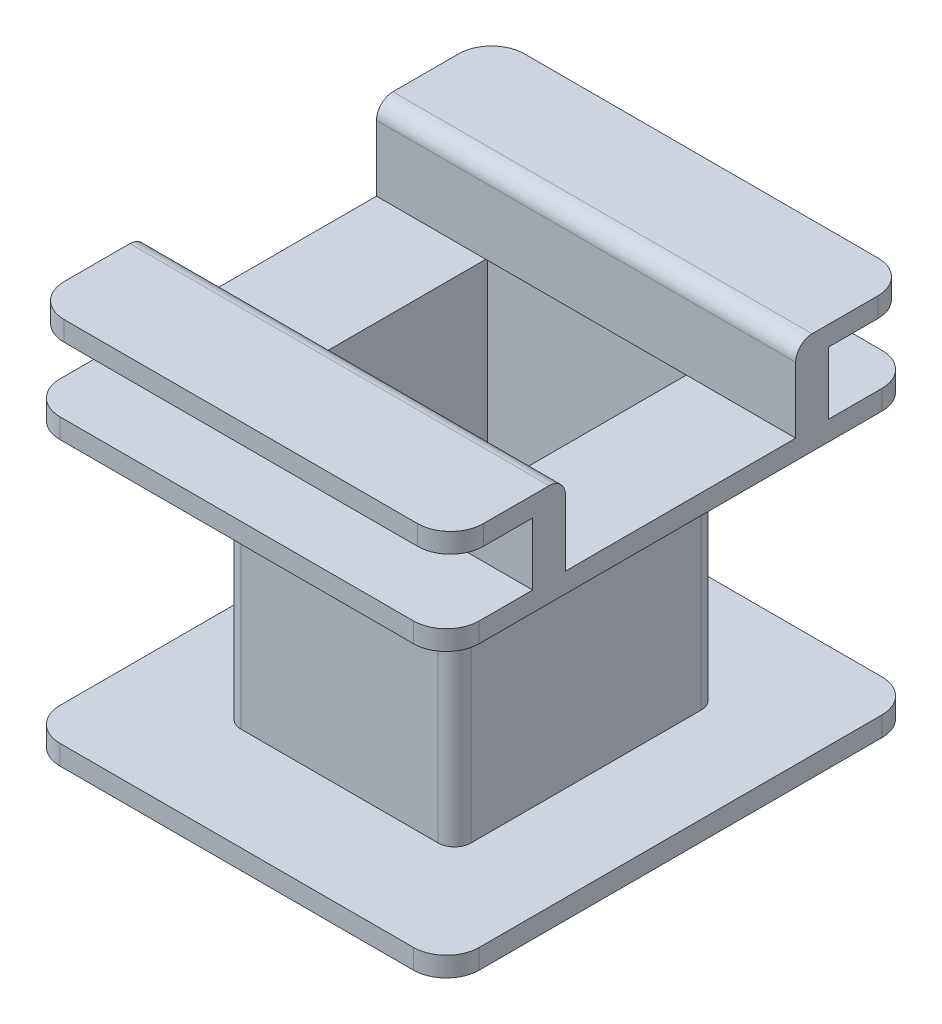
from build123d import *

# Parameters (mm, degrees)
SKETCH1_W               = 14
SKETCH1_H               = 16
BOSS_EXTRUDE1_DEPTH     = 16
FILLET1_R               = 1
CUT_EXTRUDE1_DEPTH      = 20.209372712
CUT_EXTRUDE1_DEPTH_BACK = 20.209372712
SKETCH2_W               = 12.2
SKETCH2_H               = 14.2
SKETCH3_W               = 25.5
SKETCH3_H               = 28.5
BOSS_EXTRUDE2_DEPTH     = 1.2
FILLET2_R               = 2
SKETCH4_W               = 25.5
SKETCH4_H               = 28.5
BOSS_EXTRUDE3_DEPTH     = 1.2
FILLET3_R               = 2
CUT_EXTRUDE2_DEPTH      = 27.536484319
CUT_EXTRUDE2_DEPTH_BACK = 27.536484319
SKETCH5_W               = 12.2
SKETCH5_H               = 14.2
SKETCH6_W               = 25.5
SKETCH6_H               = 1.998944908
BOSS_EXTRUDE4_DEPTH     = 5
SKETCH7_W               = 25.5
SKETCH7_H               = 1.2
BOSS_EXTRUDE5_DEPTH     = 5
FILLET4_R               = 2
SKETCH8_W               = 25.5
SKETCH8_H               = 1.997277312
BOSS_EXTRUDE6_DEPTH     = 5
SKETCH9_W               = 25.5
SKETCH9_H               = 1.2
BOSS_EXTRUDE7_DEPTH     = 5
FILLET5_R               = 2
FILLET6_R               = 1


with BuildPart() as part:
    # Sketch1 → Boss-Extrude1 (new body)
    with BuildSketch(Plane(origin=(0, 0, 0), x_dir=(1, 0, 0), z_dir=(0, 1, 0))):
        Rectangle(SKETCH1_W, SKETCH1_H)
    extrude(amount=BOSS_EXTRUDE1_DEPTH)

    # Fillet1
    fillet1_edges = [part.edges().sort_by_distance(p)[0] for p in [
        (7, 8, 8),
        (-7, 8, 8),
        (-7, 8, -8),
        (7, 8, -8),
    ]]
    fillet(fillet1_edges, radius=FILLET1_R)

    # Sketch2 → Cut-Extrude1 (cut, two sides: drawn at the far end of the back side and taken through both)
    with BuildSketch(Plane(origin=(0, 16, 0), x_dir=(1, 0, 0), z_dir=(0, 1, 0)).offset(-CUT_EXTRUDE1_DEPTH_BACK)):
        Rectangle(SKETCH2_W, SKETCH2_H)
    extrude(amount=CUT_EXTRUDE1_DEPTH + CUT_EXTRUDE1_DEPTH_BACK, mode=Mode.SUBTRACT)

    # Sketch3 → Boss-Extrude2 (add)
    with BuildSketch(Plane(origin=(0, 16, 0), x_dir=(1, 0, 0), z_dir=(0, 1, 0))):
        Rectangle(SKETCH3_W, SKETCH3_H)
    extrude(amount=BOSS_EXTRUDE2_DEPTH)

    # Fillet2
    fillet2_edges = [part.edges().sort_by_distance(p)[0] for p in [
        (12.75, 16.6, 14.25),
        (12.75, 16.6, -14.25),
        (-12.75, 16.6, -14.25),
        (-12.75, 16.6, 14.25),
    ]]
    fillet(fillet2_edges, radius=FILLET2_R)

    # Sketch4 → Boss-Extrude3 (add)
    with BuildSketch(Plane.XZ):
        Rectangle(SKETCH4_W, SKETCH4_H)
    extrude(amount=BOSS_EXTRUDE3_DEPTH)

    # Fillet3
    fillet3_edges = [part.edges().sort_by_distance(p)[0] for p in [
        (12.75, -0.6, -14.25),
        (12.75, -0.6, 14.25),
        (-12.75, -0.6, 14.25),
        (-12.75, -0.6, -14.25),
    ]]
    fillet(fillet3_edges, radius=FILLET3_R)

    # Sketch5 → Cut-Extrude2 (cut, two sides: drawn at the far end of the back side and taken through both)
    with BuildSketch(Plane.XZ.offset(1.2).offset(-CUT_EXTRUDE2_DEPTH_BACK)):
        Rectangle(SKETCH5_W, SKETCH5_H)
    extrude(amount=CUT_EXTRUDE2_DEPTH + CUT_EXTRUDE2_DEPTH_BACK, mode=Mode.SUBTRACT)

    # Sketch6 → Boss-Extrude4 (add)
    with BuildSketch(Plane(origin=(0, 17.2, 0), x_dir=(1, 0, 0), z_dir=(0, 1, 0))):
        with Locations((0, -7.999472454)):
            Rectangle(SKETCH6_W, SKETCH6_H)
    extrude(amount=BOSS_EXTRUDE4_DEPTH)

    # Sketch7 → Boss-Extrude5 (add)
    with BuildSketch(Plane.XY.offset(8.998944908)):
        with Locations((0, 21.6)):
            Rectangle(SKETCH7_W, SKETCH7_H)
    extrude(amount=BOSS_EXTRUDE5_DEPTH)

    # Fillet4
    fillet4_edges = [part.edges().sort_by_distance(p)[0] for p in [
        (-12.75, 21.6, 13.998944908),
        (12.75, 21.6, 13.998944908),
    ]]
    fillet(fillet4_edges, radius=FILLET4_R)

    # Sketch8 → Boss-Extrude6 (add)
    with BuildSketch(Plane(origin=(0, 17.2, 0), x_dir=(1, 0, 0), z_dir=(0, 1, 0))):
        with Locations((0, 7.998638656)):
            Rectangle(SKETCH8_W, SKETCH8_H)
    extrude(amount=BOSS_EXTRUDE6_DEPTH)

    # Sketch9 → Boss-Extrude7 (add)
    with BuildSketch(Plane(origin=(0, 0, -8.997277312), x_dir=(-1, 0, 0), z_dir=(0, 0, -1))):
        with Locations((0, 21.6)):
            Rectangle(SKETCH9_W, SKETCH9_H)
    extrude(amount=BOSS_EXTRUDE7_DEPTH)

    # Fillet5
    fillet5_edges = [part.edges().sort_by_distance(p)[0] for p in [
        (12.75, 21.6, -13.997277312),
        (-12.75, 21.6, -13.997277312),
    ]]
    fillet(fillet5_edges, radius=FILLET5_R)

    # Fillet6
    fillet6_edges = [part.edges().sort_by_distance(p)[0] for p in [
        (0, 22.2, 7),
        (0, 22.2, -7),
    ]]
    fillet(fillet6_edges, radius=FILLET6_R)


solid = part.part
